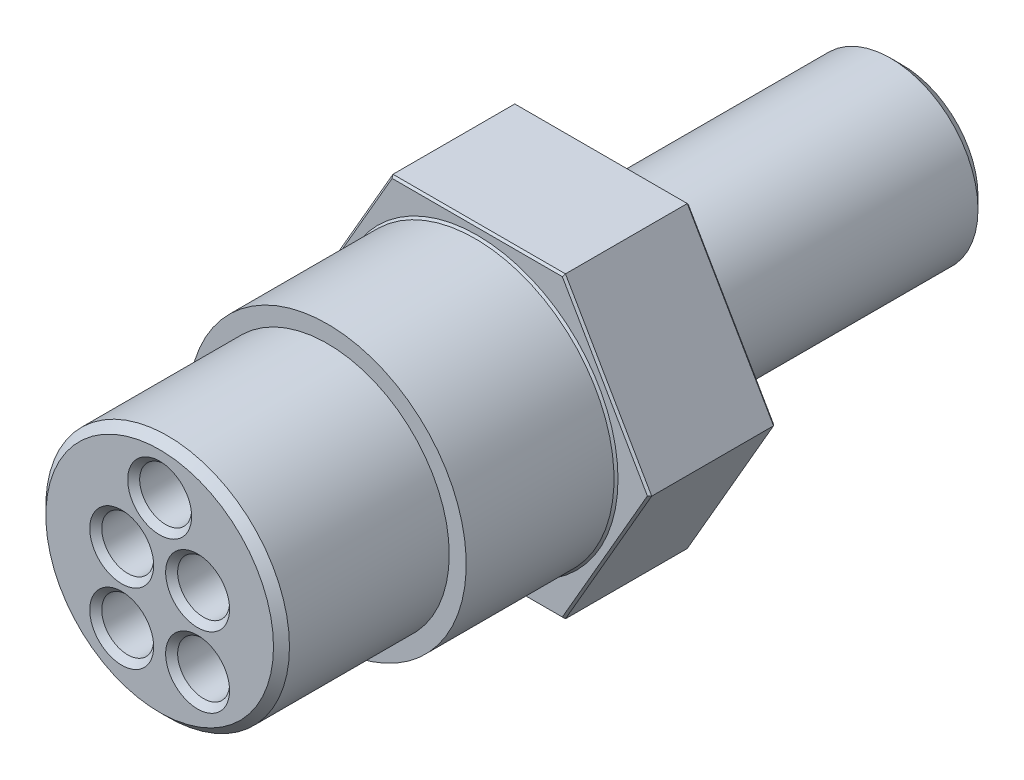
from build123d import *

# Parameters (mm, degrees)
SKETCH1_R      = 5.55625
POST_DEPTH     = 19.05
CHAMFER1_SIZE  = 0.762
HEX_2_DEPTH    = 8.001
SKETCH5_R      = 8.8265
EXTRUDE1_DEPTH = 9.525
CHAMFER2_SIZE  = 0.127
SKETCH3_R      = 7.747
RUBBER_DEPTH   = 10.668
CHAMFER3_SIZE  = 0.508
SKETCH4_R      = 1.651
SOCKETS_DEPTH  = 6.35
CHAMFER4_SIZE  = 0.381


with BuildPart() as part:
    # Sketch1 → post (new body)
    with BuildSketch(Plane.XY):
        Circle(SKETCH1_R)
    extrude(amount=-POST_DEPTH)

    # Chamfer1
    chamfer1_edges = [part.edges().sort_by_distance(p)[0] for p in [
        (-5.55625, 0, -19.05),
    ]]
    chamfer(chamfer1_edges, length=CHAMFER1_SIZE)

    # Sketch2 → hex 2 (add)
    with BuildSketch(Plane.XY):
        Polygon((-5.484596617, 9.4996), (-10.969193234, 0), (-5.484596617, -9.4996), (5.484596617, -9.4996), (10.969193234, 0), (5.484596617, 9.4996), align=None)
    extrude(amount=HEX_2_DEPTH)

    # Sketch5 → Extrude1 (add)
    with BuildSketch(Plane.XY.offset(8.001)):
        with Locations(Location((0, 0, 0), (0, 0, 180))):
            Circle(SKETCH5_R)
    extrude(amount=EXTRUDE1_DEPTH)

    # Chamfer2
    chamfer2_edges = [part.edges().sort_by_distance(p)[0] for p in [
        (8.226894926, 4.7498, 0),
        (0, 9.4996, 8.001),
        (-8.226894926, 4.7498, 8.001),
        (-8.226894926, -4.7498, 8.001),
        (0, -9.4996, 8.001),
        (8.226894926, -4.7498, 8.001),
        (8.226894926, 4.7498, 8.001),
        (8.8265, 0, 8.001),
        (0, 9.4996, 0),
        (-8.226894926, -4.7498, 0),
        (0, -9.4996, 0),
        (8.226894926, -4.7498, 0),
    ]]
    chamfer(chamfer2_edges, length=CHAMFER2_SIZE)

    # Sketch3 → rubber (add)
    with BuildSketch(Plane.XY.offset(17.526)):
        Circle(SKETCH3_R)
    extrude(amount=RUBBER_DEPTH)

    # Chamfer3
    chamfer3_edges = [part.edges().sort_by_distance(p)[0] for p in [
        (-7.747, 0, 28.194),
    ]]
    chamfer(chamfer3_edges, length=CHAMFER3_SIZE)

    # Sketch4 → sockets (cut)
    with BuildSketch(Plane.XY.offset(28.194)):
        with Locations((0, 4.572)):
            Circle(SKETCH4_R)
        with Locations((2.413, -3.81)):
            Circle(SKETCH4_R)
        with Locations((-2.413, 0.672937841)):
            Circle(SKETCH4_R)
        with Locations((-2.413, -3.81)):
            Circle(SKETCH4_R)
        with Locations((2.413, 0.672937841)):
            Circle(SKETCH4_R)
    extrude(amount=-SOCKETS_DEPTH, mode=Mode.SUBTRACT)

    # Chamfer4
    chamfer4_edges = [part.edges().sort_by_distance(p)[0] for p in [
        (0.762, -3.81, 28.194),
        (-1.651, 4.572, 28.194),
        (-4.064, 0.672937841, 28.194),
        (-4.064, -3.81, 28.194),
        (0.762, 0.672937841, 28.194),
    ]]
    chamfer(chamfer4_edges, length=CHAMFER4_SIZE)


solid = part.part
